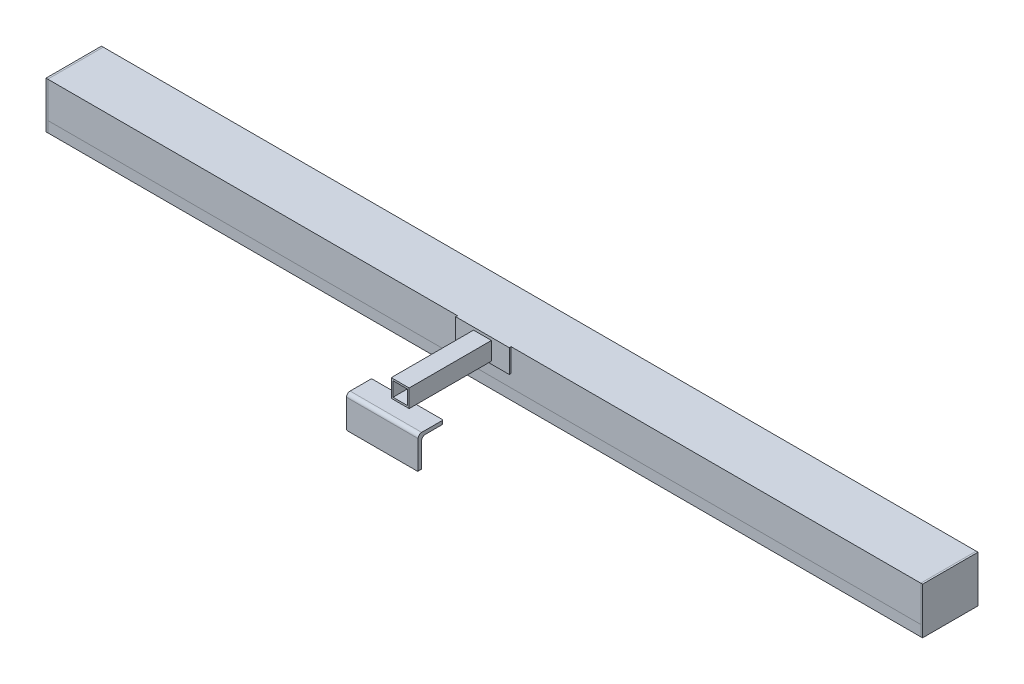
ISO-10303-21;
HEADER;
FILE_DESCRIPTION(('STEP AP214'),'2;1');
FILE_NAME('part.step','',(''),(''),'','','');
FILE_SCHEMA(('AUTOMOTIVE_DESIGN { 1 0 10303 214 1 1 1 1 }'));
ENDSEC;
DATA;
#1=APPLICATION_CONTEXT('core data for automotive mechanical design processes');
#2=APPLICATION_PROTOCOL_DEFINITION('international standard','automotive_design',2000,#1);
#3=PRODUCT_CONTEXT('',#1,'mechanical');
#4=PRODUCT('Part','Part','',(#3));
#5=PRODUCT_RELATED_PRODUCT_CATEGORY('part','',(#4));
#6=PRODUCT_DEFINITION_FORMATION('','',#4);
#7=PRODUCT_DEFINITION_CONTEXT('part definition',#1,'design');
#8=PRODUCT_DEFINITION('design','',#6,#7);
#9=PRODUCT_DEFINITION_SHAPE('','',#8);
#10=(LENGTH_UNIT() NAMED_UNIT(*) SI_UNIT(.MILLI.,.METRE.));
#11=(NAMED_UNIT(*) PLANE_ANGLE_UNIT() SI_UNIT($,.RADIAN.));
#12=(NAMED_UNIT(*) SI_UNIT($,.STERADIAN.) SOLID_ANGLE_UNIT());
#13=UNCERTAINTY_MEASURE_WITH_UNIT(LENGTH_MEASURE(1.E-05),#10,'distance_accuracy_value','');
#14=(GEOMETRIC_REPRESENTATION_CONTEXT(3) GLOBAL_UNCERTAINTY_ASSIGNED_CONTEXT((#13)) GLOBAL_UNIT_ASSIGNED_CONTEXT((#10,
#11,#12)) REPRESENTATION_CONTEXT('',''));
#15=CARTESIAN_POINT('',(0.,0.,0.));
#16=DIRECTION('',(0.,0.,1.));
#17=DIRECTION('',(1.,0.,0.));
#18=AXIS2_PLACEMENT_3D('',#15,#16,#17);
#19=CARTESIAN_POINT('',(245.,20.5,-55.));
#20=DIRECTION('',(0.,0.,-1.));
#21=DIRECTION('',(-1.,0.,0.));
#22=AXIS2_PLACEMENT_3D('',#19,#20,#21);
#23=PLANE('',#22);
#24=DIRECTION('',(0.,-1.,0.));
#25=VECTOR('',#24,1.);
#26=CARTESIAN_POINT('',(244.,20.5,-55.));
#27=LINE('',#26,#25);
#28=CARTESIAN_POINT('',(244.,20.5,-55.));
#29=VERTEX_POINT('',#28);
#30=CARTESIAN_POINT('',(244.,-5.50000000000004,-55.));
#31=VERTEX_POINT('',#30);
#32=EDGE_CURVE('E117',#29,#31,#27,.T.);
#33=ORIENTED_EDGE('',*,*,#32,.T.);
#34=DIRECTION('',(-1.,0.,0.));
#35=VECTOR('',#34,1.);
#36=CARTESIAN_POINT('',(245.,-5.50000000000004,-55.));
#37=LINE('',#36,#35);
#38=CARTESIAN_POINT('',(245.,-5.50000000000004,-55.));
#39=VERTEX_POINT('',#38);
#40=EDGE_CURVE('E12',#39,#31,#37,.T.);
#41=ORIENTED_EDGE('',*,*,#40,.F.);
#42=DIRECTION('',(0.,-1.,0.));
#43=VECTOR('',#42,1.);
#44=CARTESIAN_POINT('',(245.,20.5,-55.));
#45=LINE('',#44,#43);
#46=CARTESIAN_POINT('',(245.,20.5,-55.));
#47=VERTEX_POINT('',#46);
#48=EDGE_CURVE('E105',#47,#39,#45,.T.);
#49=ORIENTED_EDGE('',*,*,#48,.F.);
#50=DIRECTION('',(-1.,0.,0.));
#51=VECTOR('',#50,1.);
#52=CARTESIAN_POINT('',(245.,20.5,-55.));
#53=LINE('',#52,#51);
#54=EDGE_CURVE('E113',#47,#29,#53,.T.);
#55=ORIENTED_EDGE('',*,*,#54,.T.);
#56=EDGE_LOOP('',(#33,#41,#49,#55));
#57=FACE_BOUND('',#56,.T.);
#58=ADVANCED_FACE('F54',(#57),#23,.F.);
#59=CARTESIAN_POINT('',(245.,-5.50000000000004,-55.));
#60=DIRECTION('',(0.,1.,0.));
#61=DIRECTION('',(0.,0.,1.));
#62=AXIS2_PLACEMENT_3D('',#59,#60,#61);
#63=PLANE('',#62);
#64=DIRECTION('',(0.,0.,-1.));
#65=VECTOR('',#64,1.);
#66=CARTESIAN_POINT('',(244.,-5.50000000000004,-55.));
#67=LINE('',#66,#65);
#68=CARTESIAN_POINT('',(244.,-5.50000000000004,-86.));
#69=VERTEX_POINT('',#68);
#70=EDGE_CURVE('E109',#31,#69,#67,.T.);
#71=ORIENTED_EDGE('',*,*,#70,.T.);
#72=DIRECTION('',(-1.,0.,0.));
#73=VECTOR('',#72,1.);
#74=CARTESIAN_POINT('',(245.,-5.50000000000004,-86.));
#75=LINE('',#74,#73);
#76=CARTESIAN_POINT('',(245.,-5.50000000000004,-86.));
#77=VERTEX_POINT('',#76);
#78=EDGE_CURVE('E62',#77,#69,#75,.T.);
#79=ORIENTED_EDGE('',*,*,#78,.F.);
#80=DIRECTION('',(0.,0.,-1.));
#81=VECTOR('',#80,1.);
#82=CARTESIAN_POINT('',(245.,-5.50000000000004,-55.));
#83=LINE('',#82,#81);
#84=EDGE_CURVE('E100',#39,#77,#83,.T.);
#85=ORIENTED_EDGE('',*,*,#84,.F.);
#86=ORIENTED_EDGE('',*,*,#40,.T.);
#87=EDGE_LOOP('',(#71,#79,#85,#86));
#88=FACE_BOUND('',#87,.T.);
#89=ADVANCED_FACE('F108',(#88),#63,.F.);
#90=CARTESIAN_POINT('',(245.,20.5,-86.));
#91=DIRECTION('',(0.,0.,1.));
#92=DIRECTION('',(1.,0.,0.));
#93=AXIS2_PLACEMENT_3D('',#90,#91,#92);
#94=PLANE('',#93);
#95=DIRECTION('',(0.,1.,0.));
#96=VECTOR('',#95,1.);
#97=CARTESIAN_POINT('',(244.,20.5,-86.));
#98=LINE('',#97,#96);
#99=CARTESIAN_POINT('',(244.,20.5,-86.));
#100=VERTEX_POINT('',#99);
#101=EDGE_CURVE('E87',#69,#100,#98,.T.);
#102=ORIENTED_EDGE('',*,*,#101,.T.);
#103=DIRECTION('',(-1.,0.,0.));
#104=VECTOR('',#103,1.);
#105=CARTESIAN_POINT('',(245.,20.5,-86.));
#106=LINE('',#105,#104);
#107=CARTESIAN_POINT('',(245.,20.5,-86.));
#108=VERTEX_POINT('',#107);
#109=EDGE_CURVE('E110',#108,#100,#106,.T.);
#110=ORIENTED_EDGE('',*,*,#109,.F.);
#111=DIRECTION('',(0.,1.,0.));
#112=VECTOR('',#111,1.);
#113=CARTESIAN_POINT('',(245.,20.5,-86.));
#114=LINE('',#113,#112);
#115=EDGE_CURVE('E103',#77,#108,#114,.T.);
#116=ORIENTED_EDGE('',*,*,#115,.F.);
#117=ORIENTED_EDGE('',*,*,#78,.T.);
#118=EDGE_LOOP('',(#102,#110,#116,#117));
#119=FACE_BOUND('',#118,.T.);
#120=ADVANCED_FACE('F111',(#119),#94,.F.);
#121=CARTESIAN_POINT('',(245.,20.5,-55.));
#122=DIRECTION('',(0.,-1.,0.));
#123=DIRECTION('',(0.,0.,-1.));
#124=AXIS2_PLACEMENT_3D('',#121,#122,#123);
#125=PLANE('',#124);
#126=DIRECTION('',(0.,0.,1.));
#127=VECTOR('',#126,1.);
#128=CARTESIAN_POINT('',(244.,20.5,-55.));
#129=LINE('',#128,#127);
#130=EDGE_CURVE('E93',#100,#29,#129,.T.);
#131=ORIENTED_EDGE('',*,*,#130,.T.);
#132=ORIENTED_EDGE('',*,*,#54,.F.);
#133=DIRECTION('',(0.,0.,1.));
#134=VECTOR('',#133,1.);
#135=CARTESIAN_POINT('',(245.,20.5,-55.));
#136=LINE('',#135,#134);
#137=EDGE_CURVE('E70',#108,#47,#136,.T.);
#138=ORIENTED_EDGE('',*,*,#137,.F.);
#139=ORIENTED_EDGE('',*,*,#109,.T.);
#140=EDGE_LOOP('',(#131,#132,#138,#139));
#141=FACE_BOUND('',#140,.T.);
#142=ADVANCED_FACE('F124',(#141),#125,.F.);
#143=CARTESIAN_POINT('',(245.,0.,0.));
#144=DIRECTION('',(1.,0.,0.));
#145=DIRECTION('',(0.,0.,-1.));
#146=AXIS2_PLACEMENT_3D('',#143,#144,#145);
#147=PLANE('',#146);
#148=ORIENTED_EDGE('',*,*,#48,.T.);
#149=ORIENTED_EDGE('',*,*,#84,.T.);
#150=ORIENTED_EDGE('',*,*,#115,.T.);
#151=ORIENTED_EDGE('',*,*,#137,.T.);
#152=EDGE_LOOP('',(#148,#149,#150,#151));
#153=FACE_BOUND('',#152,.T.);
#154=ADVANCED_FACE('F101',(#153),#147,.T.);
#155=CARTESIAN_POINT('',(244.,0.,0.));
#156=DIRECTION('',(1.,0.,0.));
#157=DIRECTION('',(0.,0.,-1.));
#158=AXIS2_PLACEMENT_3D('',#155,#156,#157);
#159=PLANE('',#158);
#160=ORIENTED_EDGE('',*,*,#32,.F.);
#161=ORIENTED_EDGE('',*,*,#130,.F.);
#162=ORIENTED_EDGE('',*,*,#101,.F.);
#163=ORIENTED_EDGE('',*,*,#70,.F.);
#164=EDGE_LOOP('',(#160,#161,#162,#163));
#165=FACE_BOUND('',#164,.T.);
#166=ADVANCED_FACE('F127',(#165),#159,.F.);
#167=CLOSED_SHELL('',(#58,#89,#120,#142,#154,#166));
#168=MANIFOLD_SOLID_BREP('B2',#167);
#169=CARTESIAN_POINT('',(-245.,20.5,-86.));
#170=DIRECTION('',(0.,0.,1.));
#171=DIRECTION('',(1.,0.,0.));
#172=AXIS2_PLACEMENT_3D('',#169,#170,#171);
#173=PLANE('',#172);
#174=DIRECTION('',(0.,-1.,0.));
#175=VECTOR('',#174,1.);
#176=CARTESIAN_POINT('',(-244.,20.5,-86.));
#177=LINE('',#176,#175);
#178=CARTESIAN_POINT('',(-244.,20.5,-86.));
#179=VERTEX_POINT('',#178);
#180=CARTESIAN_POINT('',(-244.,-5.50000000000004,-86.));
#181=VERTEX_POINT('',#180);
#182=EDGE_CURVE('E251',#179,#181,#177,.T.);
#183=ORIENTED_EDGE('',*,*,#182,.T.);
#184=DIRECTION('',(1.,0.,0.));
#185=VECTOR('',#184,1.);
#186=CARTESIAN_POINT('',(-245.,-5.50000000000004,-86.));
#187=LINE('',#186,#185);
#188=CARTESIAN_POINT('',(-245.,-5.50000000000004,-86.));
#189=VERTEX_POINT('',#188);
#190=EDGE_CURVE('E52',#189,#181,#187,.T.);
#191=ORIENTED_EDGE('',*,*,#190,.F.);
#192=DIRECTION('',(0.,-1.,0.));
#193=VECTOR('',#192,1.);
#194=CARTESIAN_POINT('',(-245.,20.5,-86.));
#195=LINE('',#194,#193);
#196=CARTESIAN_POINT('',(-245.,20.5,-86.));
#197=VERTEX_POINT('',#196);
#198=EDGE_CURVE('E239',#197,#189,#195,.T.);
#199=ORIENTED_EDGE('',*,*,#198,.F.);
#200=DIRECTION('',(1.,0.,0.));
#201=VECTOR('',#200,1.);
#202=CARTESIAN_POINT('',(-245.,20.5,-86.));
#203=LINE('',#202,#201);
#204=EDGE_CURVE('E247',#197,#179,#203,.T.);
#205=ORIENTED_EDGE('',*,*,#204,.T.);
#206=EDGE_LOOP('',(#183,#191,#199,#205));
#207=FACE_BOUND('',#206,.T.);
#208=ADVANCED_FACE('F188',(#207),#173,.F.);
#209=CARTESIAN_POINT('',(-245.,-5.50000000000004,-86.));
#210=DIRECTION('',(0.,1.,0.));
#211=DIRECTION('',(0.,0.,1.));
#212=AXIS2_PLACEMENT_3D('',#209,#210,#211);
#213=PLANE('',#212);
#214=DIRECTION('',(0.,0.,1.));
#215=VECTOR('',#214,1.);
#216=CARTESIAN_POINT('',(-244.,-5.50000000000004,-86.));
#217=LINE('',#216,#215);
#218=CARTESIAN_POINT('',(-244.,-5.50000000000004,-55.));
#219=VERTEX_POINT('',#218);
#220=EDGE_CURVE('E243',#181,#219,#217,.T.);
#221=ORIENTED_EDGE('',*,*,#220,.T.);
#222=DIRECTION('',(1.,0.,0.));
#223=VECTOR('',#222,1.);
#224=CARTESIAN_POINT('',(-245.,-5.50000000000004,-55.));
#225=LINE('',#224,#223);
#226=CARTESIAN_POINT('',(-245.,-5.50000000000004,-55.));
#227=VERTEX_POINT('',#226);
#228=EDGE_CURVE('E196',#227,#219,#225,.T.);
#229=ORIENTED_EDGE('',*,*,#228,.F.);
#230=DIRECTION('',(0.,0.,1.));
#231=VECTOR('',#230,1.);
#232=CARTESIAN_POINT('',(-245.,-5.50000000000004,-86.));
#233=LINE('',#232,#231);
#234=EDGE_CURVE('E234',#189,#227,#233,.T.);
#235=ORIENTED_EDGE('',*,*,#234,.F.);
#236=ORIENTED_EDGE('',*,*,#190,.T.);
#237=EDGE_LOOP('',(#221,#229,#235,#236));
#238=FACE_BOUND('',#237,.T.);
#239=ADVANCED_FACE('F242',(#238),#213,.F.);
#240=CARTESIAN_POINT('',(-245.,20.5,-55.));
#241=DIRECTION('',(0.,0.,-1.));
#242=DIRECTION('',(-1.,0.,0.));
#243=AXIS2_PLACEMENT_3D('',#240,#241,#242);
#244=PLANE('',#243);
#245=DIRECTION('',(0.,1.,0.));
#246=VECTOR('',#245,1.);
#247=CARTESIAN_POINT('',(-244.,20.5,-55.));
#248=LINE('',#247,#246);
#249=CARTESIAN_POINT('',(-244.,20.5,-55.));
#250=VERTEX_POINT('',#249);
#251=EDGE_CURVE('E221',#219,#250,#248,.T.);
#252=ORIENTED_EDGE('',*,*,#251,.T.);
#253=DIRECTION('',(1.,0.,0.));
#254=VECTOR('',#253,1.);
#255=CARTESIAN_POINT('',(-245.,20.5,-55.));
#256=LINE('',#255,#254);
#257=CARTESIAN_POINT('',(-245.,20.5,-55.));
#258=VERTEX_POINT('',#257);
#259=EDGE_CURVE('E244',#258,#250,#256,.T.);
#260=ORIENTED_EDGE('',*,*,#259,.F.);
#261=DIRECTION('',(0.,1.,0.));
#262=VECTOR('',#261,1.);
#263=CARTESIAN_POINT('',(-245.,20.5,-55.));
#264=LINE('',#263,#262);
#265=EDGE_CURVE('E237',#227,#258,#264,.T.);
#266=ORIENTED_EDGE('',*,*,#265,.F.);
#267=ORIENTED_EDGE('',*,*,#228,.T.);
#268=EDGE_LOOP('',(#252,#260,#266,#267));
#269=FACE_BOUND('',#268,.T.);
#270=ADVANCED_FACE('F245',(#269),#244,.F.);
#271=CARTESIAN_POINT('',(-245.,20.5,-86.));
#272=DIRECTION('',(0.,-1.,0.));
#273=DIRECTION('',(0.,0.,-1.));
#274=AXIS2_PLACEMENT_3D('',#271,#272,#273);
#275=PLANE('',#274);
#276=DIRECTION('',(0.,0.,-1.));
#277=VECTOR('',#276,1.);
#278=CARTESIAN_POINT('',(-244.,20.5,-86.));
#279=LINE('',#278,#277);
#280=EDGE_CURVE('E227',#250,#179,#279,.T.);
#281=ORIENTED_EDGE('',*,*,#280,.T.);
#282=ORIENTED_EDGE('',*,*,#204,.F.);
#283=DIRECTION('',(0.,0.,-1.));
#284=VECTOR('',#283,1.);
#285=CARTESIAN_POINT('',(-245.,20.5,-86.));
#286=LINE('',#285,#284);
#287=EDGE_CURVE('E204',#258,#197,#286,.T.);
#288=ORIENTED_EDGE('',*,*,#287,.F.);
#289=ORIENTED_EDGE('',*,*,#259,.T.);
#290=EDGE_LOOP('',(#281,#282,#288,#289));
#291=FACE_BOUND('',#290,.T.);
#292=ADVANCED_FACE('F258',(#291),#275,.F.);
#293=CARTESIAN_POINT('',(-245.,0.,0.));
#294=DIRECTION('',(-1.,0.,0.));
#295=DIRECTION('',(0.,0.,1.));
#296=AXIS2_PLACEMENT_3D('',#293,#294,#295);
#297=PLANE('',#296);
#298=ORIENTED_EDGE('',*,*,#198,.T.);
#299=ORIENTED_EDGE('',*,*,#234,.T.);
#300=ORIENTED_EDGE('',*,*,#265,.T.);
#301=ORIENTED_EDGE('',*,*,#287,.T.);
#302=EDGE_LOOP('',(#298,#299,#300,#301));
#303=FACE_BOUND('',#302,.T.);
#304=ADVANCED_FACE('F235',(#303),#297,.T.);
#305=CARTESIAN_POINT('',(-244.,0.,0.));
#306=DIRECTION('',(-1.,0.,0.));
#307=DIRECTION('',(0.,0.,1.));
#308=AXIS2_PLACEMENT_3D('',#305,#306,#307);
#309=PLANE('',#308);
#310=ORIENTED_EDGE('',*,*,#182,.F.);
#311=ORIENTED_EDGE('',*,*,#280,.F.);
#312=ORIENTED_EDGE('',*,*,#251,.F.);
#313=ORIENTED_EDGE('',*,*,#220,.F.);
#314=EDGE_LOOP('',(#310,#311,#312,#313));
#315=FACE_BOUND('',#314,.T.);
#316=ADVANCED_FACE('F261',(#315),#309,.F.);
#317=CLOSED_SHELL('',(#208,#239,#270,#292,#304,#316));
#318=MANIFOLD_SOLID_BREP('B6',#317);
#319=CARTESIAN_POINT('',(-244.,-5.50000000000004,-55.));
#320=DIRECTION('',(1.,0.,0.));
#321=DIRECTION('',(0.,0.,-1.));
#322=AXIS2_PLACEMENT_3D('',#319,#320,#321);
#323=PLANE('',#322);
#324=DIRECTION('',(0.,0.,-1.));
#325=VECTOR('',#324,1.);
#326=CARTESIAN_POINT('',(-244.,0.499999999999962,-55.));
#327=LINE('',#326,#325);
#328=CARTESIAN_POINT('',(-244.,0.499999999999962,-55.));
#329=VERTEX_POINT('',#328);
#330=CARTESIAN_POINT('',(-244.,0.499999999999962,-86.));
#331=VERTEX_POINT('',#330);
#332=EDGE_CURVE('E384',#329,#331,#327,.T.);
#333=ORIENTED_EDGE('',*,*,#332,.T.);
#334=DIRECTION('',(0.,1.,0.));
#335=VECTOR('',#334,1.);
#336=CARTESIAN_POINT('',(-244.,-5.50000000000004,-86.));
#337=LINE('',#336,#335);
#338=CARTESIAN_POINT('',(-244.,-5.50000000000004,-86.));
#339=VERTEX_POINT('',#338);
#340=EDGE_CURVE('E186',#339,#331,#337,.T.);
#341=ORIENTED_EDGE('',*,*,#340,.F.);
#342=DIRECTION('',(0.,0.,-1.));
#343=VECTOR('',#342,1.);
#344=CARTESIAN_POINT('',(-244.,-5.50000000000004,-55.));
#345=LINE('',#344,#343);
#346=CARTESIAN_POINT('',(-244.,-5.50000000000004,-55.));
#347=VERTEX_POINT('',#346);
#348=EDGE_CURVE('E372',#347,#339,#345,.T.);
#349=ORIENTED_EDGE('',*,*,#348,.F.);
#350=DIRECTION('',(0.,1.,0.));
#351=VECTOR('',#350,1.);
#352=CARTESIAN_POINT('',(-244.,-5.50000000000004,-55.));
#353=LINE('',#352,#351);
#354=EDGE_CURVE('E380',#347,#329,#353,.T.);
#355=ORIENTED_EDGE('',*,*,#354,.T.);
#356=EDGE_LOOP('',(#333,#341,#349,#355));
#357=FACE_BOUND('',#356,.T.);
#358=ADVANCED_FACE('F321',(#357),#323,.F.);
#359=CARTESIAN_POINT('',(-244.,-5.50000000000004,-86.));
#360=DIRECTION('',(0.,0.,1.));
#361=DIRECTION('',(1.,0.,0.));
#362=AXIS2_PLACEMENT_3D('',#359,#360,#361);
#363=PLANE('',#362);
#364=DIRECTION('',(1.,0.,0.));
#365=VECTOR('',#364,1.);
#366=CARTESIAN_POINT('',(-244.,0.499999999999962,-86.));
#367=LINE('',#366,#365);
#368=CARTESIAN_POINT('',(244.,0.499999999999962,-86.));
#369=VERTEX_POINT('',#368);
#370=EDGE_CURVE('E376',#331,#369,#367,.T.);
#371=ORIENTED_EDGE('',*,*,#370,.T.);
#372=DIRECTION('',(0.,1.,0.));
#373=VECTOR('',#372,1.);
#374=CARTESIAN_POINT('',(244.,-5.50000000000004,-86.));
#375=LINE('',#374,#373);
#376=CARTESIAN_POINT('',(244.,-5.50000000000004,-86.));
#377=VERTEX_POINT('',#376);
#378=EDGE_CURVE('E329',#377,#369,#375,.T.);
#379=ORIENTED_EDGE('',*,*,#378,.F.);
#380=DIRECTION('',(1.,0.,0.));
#381=VECTOR('',#380,1.);
#382=CARTESIAN_POINT('',(-244.,-5.50000000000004,-86.));
#383=LINE('',#382,#381);
#384=EDGE_CURVE('E367',#339,#377,#383,.T.);
#385=ORIENTED_EDGE('',*,*,#384,.F.);
#386=ORIENTED_EDGE('',*,*,#340,.T.);
#387=EDGE_LOOP('',(#371,#379,#385,#386));
#388=FACE_BOUND('',#387,.T.);
#389=ADVANCED_FACE('F375',(#388),#363,.F.);
#390=CARTESIAN_POINT('',(244.,-5.50000000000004,-55.));
#391=DIRECTION('',(-1.,0.,0.));
#392=DIRECTION('',(0.,0.,1.));
#393=AXIS2_PLACEMENT_3D('',#390,#391,#392);
#394=PLANE('',#393);
#395=DIRECTION('',(0.,0.,1.));
#396=VECTOR('',#395,1.);
#397=CARTESIAN_POINT('',(244.,0.499999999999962,-55.));
#398=LINE('',#397,#396);
#399=CARTESIAN_POINT('',(244.,0.499999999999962,-55.));
#400=VERTEX_POINT('',#399);
#401=EDGE_CURVE('E354',#369,#400,#398,.T.);
#402=ORIENTED_EDGE('',*,*,#401,.T.);
#403=DIRECTION('',(0.,1.,0.));
#404=VECTOR('',#403,1.);
#405=CARTESIAN_POINT('',(244.,-5.50000000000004,-55.));
#406=LINE('',#405,#404);
#407=CARTESIAN_POINT('',(244.,-5.50000000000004,-55.));
#408=VERTEX_POINT('',#407);
#409=EDGE_CURVE('E377',#408,#400,#406,.T.);
#410=ORIENTED_EDGE('',*,*,#409,.F.);
#411=DIRECTION('',(0.,0.,1.));
#412=VECTOR('',#411,1.);
#413=CARTESIAN_POINT('',(244.,-5.50000000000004,-55.));
#414=LINE('',#413,#412);
#415=EDGE_CURVE('E370',#377,#408,#414,.T.);
#416=ORIENTED_EDGE('',*,*,#415,.F.);
#417=ORIENTED_EDGE('',*,*,#378,.T.);
#418=EDGE_LOOP('',(#402,#410,#416,#417));
#419=FACE_BOUND('',#418,.T.);
#420=ADVANCED_FACE('F378',(#419),#394,.F.);
#421=CARTESIAN_POINT('',(-244.,-5.50000000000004,-55.));
#422=DIRECTION('',(0.,0.,-1.));
#423=DIRECTION('',(-1.,0.,0.));
#424=AXIS2_PLACEMENT_3D('',#421,#422,#423);
#425=PLANE('',#424);
#426=DIRECTION('',(-1.,0.,0.));
#427=VECTOR('',#426,1.);
#428=CARTESIAN_POINT('',(-244.,0.499999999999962,-55.));
#429=LINE('',#428,#427);
#430=EDGE_CURVE('E360',#400,#329,#429,.T.);
#431=ORIENTED_EDGE('',*,*,#430,.T.);
#432=ORIENTED_EDGE('',*,*,#354,.F.);
#433=DIRECTION('',(-1.,0.,0.));
#434=VECTOR('',#433,1.);
#435=CARTESIAN_POINT('',(-244.,-5.50000000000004,-55.));
#436=LINE('',#435,#434);
#437=EDGE_CURVE('E337',#408,#347,#436,.T.);
#438=ORIENTED_EDGE('',*,*,#437,.F.);
#439=ORIENTED_EDGE('',*,*,#409,.T.);
#440=EDGE_LOOP('',(#431,#432,#438,#439));
#441=FACE_BOUND('',#440,.T.);
#442=ADVANCED_FACE('F391',(#441),#425,.F.);
#443=CARTESIAN_POINT('',(0.,-5.50000000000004,0.));
#444=DIRECTION('',(0.,-1.,0.));
#445=DIRECTION('',(0.,0.,-1.));
#446=AXIS2_PLACEMENT_3D('',#443,#444,#445);
#447=PLANE('',#446);
#448=ORIENTED_EDGE('',*,*,#348,.T.);
#449=ORIENTED_EDGE('',*,*,#384,.T.);
#450=ORIENTED_EDGE('',*,*,#415,.T.);
#451=ORIENTED_EDGE('',*,*,#437,.T.);
#452=EDGE_LOOP('',(#448,#449,#450,#451));
#453=FACE_BOUND('',#452,.T.);
#454=ADVANCED_FACE('F368',(#453),#447,.T.);
#455=CARTESIAN_POINT('',(0.,0.499999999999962,0.));
#456=DIRECTION('',(0.,-1.,0.));
#457=DIRECTION('',(0.,0.,-1.));
#458=AXIS2_PLACEMENT_3D('',#455,#456,#457);
#459=PLANE('',#458);
#460=ORIENTED_EDGE('',*,*,#332,.F.);
#461=ORIENTED_EDGE('',*,*,#430,.F.);
#462=ORIENTED_EDGE('',*,*,#401,.F.);
#463=ORIENTED_EDGE('',*,*,#370,.F.);
#464=EDGE_LOOP('',(#460,#461,#462,#463));
#465=FACE_BOUND('',#464,.T.);
#466=ADVANCED_FACE('F394',(#465),#459,.F.);
#467=CLOSED_SHELL('',(#358,#389,#420,#442,#454,#466));
#468=MANIFOLD_SOLID_BREP('B46',#467);
#469=CARTESIAN_POINT('',(-20.,9.,2.));
#470=DIRECTION('',(0.,-1.,0.));
#471=DIRECTION('',(0.,0.,-1.));
#472=AXIS2_PLACEMENT_3D('',#469,#470,#471);
#473=PLANE('',#472);
#474=DIRECTION('',(0.,0.,1.));
#475=VECTOR('',#474,1.);
#476=CARTESIAN_POINT('',(-5.,9.,-54.));
#477=LINE('',#476,#475);
#478=CARTESIAN_POINT('',(-5.,9.,-12.));
#479=VERTEX_POINT('',#478);
#480=CARTESIAN_POINT('',(-5.,9.,-8.));
#481=VERTEX_POINT('',#480);
#482=EDGE_CURVE('E777',#479,#481,#477,.T.);
#483=ORIENTED_EDGE('',*,*,#482,.F.);
#484=DIRECTION('',(-1.,0.,0.));
#485=VECTOR('',#484,1.);
#486=CARTESIAN_POINT('',(0.,9.,-12.));
#487=LINE('',#486,#485);
#488=CARTESIAN_POINT('',(-19.5,9.,-12.));
#489=VERTEX_POINT('',#488);
#490=EDGE_CURVE('E776',#479,#489,#487,.T.);
#491=ORIENTED_EDGE('',*,*,#490,.T.);
#492=CARTESIAN_POINT('',(-19.5,9.,-11.5));
#493=DIRECTION('',(0.,-1.,0.));
#494=DIRECTION('',(0.,0.,-1.));
#495=AXIS2_PLACEMENT_3D('',#492,#493,#494);
#496=CIRCLE('',#495,0.5);
#497=CARTESIAN_POINT('',(-20.,9.,-11.5));
#498=VERTEX_POINT('',#497);
#499=EDGE_CURVE('E908',#489,#498,#496,.F.);
#500=ORIENTED_EDGE('',*,*,#499,.T.);
#501=DIRECTION('',(0.,0.,-1.));
#502=VECTOR('',#501,1.);
#503=CARTESIAN_POINT('',(-20.,9.,2.));
#504=LINE('',#503,#502);
#505=CARTESIAN_POINT('',(-20.,9.,0.));
#506=VERTEX_POINT('',#505);
#507=EDGE_CURVE('E827',#506,#498,#504,.T.);
#508=ORIENTED_EDGE('',*,*,#507,.F.);
#509=DIRECTION('',(-1.,0.,0.));
#510=VECTOR('',#509,1.);
#511=CARTESIAN_POINT('',(-20.,9.,0.));
#512=LINE('',#511,#510);
#513=CARTESIAN_POINT('',(20.,9.,0.));
#514=VERTEX_POINT('',#513);
#515=EDGE_CURVE('E864',#506,#514,#512,.F.);
#516=ORIENTED_EDGE('',*,*,#515,.T.);
#517=DIRECTION('',(0.,0.,-1.));
#518=VECTOR('',#517,1.);
#519=CARTESIAN_POINT('',(20.,9.,2.));
#520=LINE('',#519,#518);
#521=CARTESIAN_POINT('',(20.,9.,-11.5));
#522=VERTEX_POINT('',#521);
#523=EDGE_CURVE('E839',#514,#522,#520,.T.);
#524=ORIENTED_EDGE('',*,*,#523,.T.);
#525=CARTESIAN_POINT('',(19.5,9.,-11.5));
#526=DIRECTION('',(0.,-1.,0.));
#527=DIRECTION('',(0.,0.,-1.));
#528=AXIS2_PLACEMENT_3D('',#525,#526,#527);
#529=CIRCLE('',#528,0.5);
#530=CARTESIAN_POINT('',(19.5,9.,-12.));
#531=VERTEX_POINT('',#530);
#532=EDGE_CURVE('E454',#522,#531,#529,.F.);
#533=ORIENTED_EDGE('',*,*,#532,.T.);
#534=CARTESIAN_POINT('',(5.,9.,-12.));
#535=VERTEX_POINT('',#534);
#536=EDGE_CURVE('E805',#531,#535,#487,.T.);
#537=ORIENTED_EDGE('',*,*,#536,.T.);
#538=DIRECTION('',(0.,0.,1.));
#539=VECTOR('',#538,1.);
#540=CARTESIAN_POINT('',(5.,9.,-54.));
#541=LINE('',#540,#539);
#542=CARTESIAN_POINT('',(5.,9.,-8.));
#543=VERTEX_POINT('',#542);
#544=EDGE_CURVE('E466',#535,#543,#541,.T.);
#545=ORIENTED_EDGE('',*,*,#544,.T.);
#546=DIRECTION('',(1.,0.,0.));
#547=VECTOR('',#546,1.);
#548=CARTESIAN_POINT('',(0.,9.,-8.));
#549=LINE('',#548,#547);
#550=EDGE_CURVE('E461',#481,#543,#549,.T.);
#551=ORIENTED_EDGE('',*,*,#550,.F.);
#552=EDGE_LOOP('',(#483,#491,#500,#508,#516,#524,#533,#537,#545,#551));
#553=FACE_BOUND('',#552,.T.);
#554=ADVANCED_FACE('F445',(#553),#473,.F.);
#555=CARTESIAN_POINT('',(19.5,7.,-11.5));
#556=DIRECTION('',(0.,1.,0.));
#557=DIRECTION('',(0.,0.,1.));
#558=AXIS2_PLACEMENT_3D('',#555,#556,#557);
#559=CYLINDRICAL_SURFACE('',#558,0.5);
#560=DIRECTION('',(0.,-1.,0.));
#561=VECTOR('',#560,1.);
#562=CARTESIAN_POINT('',(19.5,7.,-12.));
#563=LINE('',#562,#561);
#564=CARTESIAN_POINT('',(19.5,7.,-12.));
#565=VERTEX_POINT('',#564);
#566=EDGE_CURVE('E915',#531,#565,#563,.T.);
#567=ORIENTED_EDGE('',*,*,#566,.F.);
#568=ORIENTED_EDGE('',*,*,#532,.F.);
#569=DIRECTION('',(0.,-1.,0.));
#570=VECTOR('',#569,1.);
#571=CARTESIAN_POINT('',(20.,7.,-11.5));
#572=LINE('',#571,#570);
#573=CARTESIAN_POINT('',(20.,7.,-11.5));
#574=VERTEX_POINT('',#573);
#575=EDGE_CURVE('E919',#574,#522,#572,.F.);
#576=ORIENTED_EDGE('',*,*,#575,.F.);
#577=CARTESIAN_POINT('',(19.5,7.,-11.5));
#578=DIRECTION('',(0.,1.,0.));
#579=DIRECTION('',(0.,0.,1.));
#580=AXIS2_PLACEMENT_3D('',#577,#578,#579);
#581=CIRCLE('',#580,0.5);
#582=EDGE_CURVE('E319',#565,#574,#581,.F.);
#583=ORIENTED_EDGE('',*,*,#582,.F.);
#584=EDGE_LOOP('',(#567,#568,#576,#583));
#585=FACE_BOUND('',#584,.T.);
#586=ADVANCED_FACE('F447',(#585),#559,.T.);
#587=CARTESIAN_POINT('',(-19.5,-9.,-11.5));
#588=DIRECTION('',(0.,1.,0.));
#589=DIRECTION('',(0.,0.,1.));
#590=AXIS2_PLACEMENT_3D('',#587,#588,#589);
#591=CYLINDRICAL_SURFACE('',#590,0.5);
#592=DIRECTION('',(0.,-1.,0.));
#593=VECTOR('',#592,1.);
#594=CARTESIAN_POINT('',(-20.,-9.,-11.5));
#595=LINE('',#594,#593);
#596=CARTESIAN_POINT('',(-20.,7.,-11.5));
#597=VERTEX_POINT('',#596);
#598=EDGE_CURVE('E900',#498,#597,#595,.T.);
#599=ORIENTED_EDGE('',*,*,#598,.F.);
#600=ORIENTED_EDGE('',*,*,#499,.F.);
#601=DIRECTION('',(0.,-1.,0.));
#602=VECTOR('',#601,1.);
#603=CARTESIAN_POINT('',(-19.5,-9.,-12.));
#604=LINE('',#603,#602);
#605=CARTESIAN_POINT('',(-19.5,7.,-12.));
#606=VERTEX_POINT('',#605);
#607=EDGE_CURVE('E904',#606,#489,#604,.F.);
#608=ORIENTED_EDGE('',*,*,#607,.F.);
#609=CARTESIAN_POINT('',(-19.5,7.,-11.5));
#610=DIRECTION('',(0.,1.,0.));
#611=DIRECTION('',(0.,0.,1.));
#612=AXIS2_PLACEMENT_3D('',#609,#610,#611);
#613=CIRCLE('',#612,0.5);
#614=EDGE_CURVE('E911',#597,#606,#613,.F.);
#615=ORIENTED_EDGE('',*,*,#614,.F.);
#616=EDGE_LOOP('',(#599,#600,#608,#615));
#617=FACE_BOUND('',#616,.T.);
#618=ADVANCED_FACE('F941',(#617),#591,.T.);
#619=CARTESIAN_POINT('',(-19.5,-8.5,2.));
#620=DIRECTION('',(0.,0.,-1.));
#621=DIRECTION('',(-1.,0.,0.));
#622=AXIS2_PLACEMENT_3D('',#619,#620,#621);
#623=CYLINDRICAL_SURFACE('',#622,0.5);
#624=DIRECTION('',(0.,0.,-1.));
#625=VECTOR('',#624,1.);
#626=CARTESIAN_POINT('',(-19.5,-9.,2.));
#627=LINE('',#626,#625);
#628=CARTESIAN_POINT('',(-19.5,-9.,2.));
#629=VERTEX_POINT('',#628);
#630=CARTESIAN_POINT('',(-19.5,-9.,0.));
#631=VERTEX_POINT('',#630);
#632=EDGE_CURVE('E886',#629,#631,#627,.T.);
#633=ORIENTED_EDGE('',*,*,#632,.F.);
#634=CARTESIAN_POINT('',(-19.5,-8.5,2.));
#635=DIRECTION('',(0.,0.,-1.));
#636=DIRECTION('',(-1.,0.,0.));
#637=AXIS2_PLACEMENT_3D('',#634,#635,#636);
#638=CIRCLE('',#637,0.5);
#639=CARTESIAN_POINT('',(-20.,-8.5,2.));
#640=VERTEX_POINT('',#639);
#641=EDGE_CURVE('E894',#640,#629,#638,.F.);
#642=ORIENTED_EDGE('',*,*,#641,.F.);
#643=DIRECTION('',(0.,0.,-1.));
#644=VECTOR('',#643,1.);
#645=CARTESIAN_POINT('',(-20.,-8.5,2.));
#646=LINE('',#645,#644);
#647=CARTESIAN_POINT('',(-20.,-8.5,0.));
#648=VERTEX_POINT('',#647);
#649=EDGE_CURVE('E890',#648,#640,#646,.F.);
#650=ORIENTED_EDGE('',*,*,#649,.F.);
#651=CARTESIAN_POINT('',(-19.5,-8.5,0.));
#652=DIRECTION('',(0.,0.,-1.));
#653=DIRECTION('',(-1.,0.,0.));
#654=AXIS2_PLACEMENT_3D('',#651,#652,#653);
#655=CIRCLE('',#654,0.5);
#656=EDGE_CURVE('E897',#631,#648,#655,.T.);
#657=ORIENTED_EDGE('',*,*,#656,.F.);
#658=EDGE_LOOP('',(#633,#642,#650,#657));
#659=FACE_BOUND('',#658,.T.);
#660=ADVANCED_FACE('F971',(#659),#623,.T.);
#661=CARTESIAN_POINT('',(19.6464466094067,-8.64644660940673,0.));
#662=DIRECTION('',(0.,0.,1.));
#663=DIRECTION('',(1.,0.,0.));
#664=AXIS2_PLACEMENT_3D('',#661,#662,#663);
#665=CYLINDRICAL_SURFACE('',#664,0.353553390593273);
#666=DIRECTION('',(0.,0.,1.));
#667=VECTOR('',#666,1.);
#668=CARTESIAN_POINT('',(19.6464466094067,-9.,2.));
#669=LINE('',#668,#667);
#670=CARTESIAN_POINT('',(19.6464466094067,-9.,0.));
#671=VERTEX_POINT('',#670);
#672=CARTESIAN_POINT('',(19.6464466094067,-9.,2.));
#673=VERTEX_POINT('',#672);
#674=EDGE_CURVE('E871',#671,#673,#669,.T.);
#675=ORIENTED_EDGE('',*,*,#674,.F.);
#676=CARTESIAN_POINT('',(19.6464466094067,-8.64644660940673,0.));
#677=DIRECTION('',(0.,0.,-1.));
#678=DIRECTION('',(-1.,0.,0.));
#679=AXIS2_PLACEMENT_3D('',#676,#677,#678);
#680=CIRCLE('',#679,0.353553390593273);
#681=CARTESIAN_POINT('',(20.,-8.64644660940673,0.));
#682=VERTEX_POINT('',#681);
#683=EDGE_CURVE('E879',#682,#671,#680,.T.);
#684=ORIENTED_EDGE('',*,*,#683,.F.);
#685=DIRECTION('',(0.,0.,1.));
#686=VECTOR('',#685,1.);
#687=CARTESIAN_POINT('',(20.,-8.64644660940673,2.));
#688=LINE('',#687,#686);
#689=CARTESIAN_POINT('',(20.,-8.64644660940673,2.));
#690=VERTEX_POINT('',#689);
#691=EDGE_CURVE('E875',#690,#682,#688,.F.);
#692=ORIENTED_EDGE('',*,*,#691,.F.);
#693=CARTESIAN_POINT('',(19.6464466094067,-8.64644660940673,2.));
#694=DIRECTION('',(0.,0.,-1.));
#695=DIRECTION('',(-1.,0.,0.));
#696=AXIS2_PLACEMENT_3D('',#693,#694,#695);
#697=CIRCLE('',#696,0.353553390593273);
#698=EDGE_CURVE('E883',#673,#690,#697,.F.);
#699=ORIENTED_EDGE('',*,*,#698,.F.);
#700=EDGE_LOOP('',(#675,#684,#692,#699));
#701=FACE_BOUND('',#700,.T.);
#702=ADVANCED_FACE('F979',(#701),#665,.T.);
#703=CARTESIAN_POINT('',(0.,0.,0.));
#704=DIRECTION('',(0.,0.,-1.));
#705=DIRECTION('',(-1.,0.,0.));
#706=AXIS2_PLACEMENT_3D('',#703,#704,#705);
#707=PLANE('',#706);
#708=DIRECTION('',(1.,0.,0.));
#709=VECTOR('',#708,1.);
#710=CARTESIAN_POINT('',(-20.,-9.,0.));
#711=LINE('',#710,#709);
#712=EDGE_CURVE('E831',#631,#671,#711,.T.);
#713=ORIENTED_EDGE('',*,*,#712,.F.);
#714=ORIENTED_EDGE('',*,*,#656,.T.);
#715=DIRECTION('',(0.,-1.,0.));
#716=VECTOR('',#715,1.);
#717=CARTESIAN_POINT('',(-20.,-9.,0.));
#718=LINE('',#717,#716);
#719=CARTESIAN_POINT('',(-20.,5.,0.));
#720=VERTEX_POINT('',#719);
#721=EDGE_CURVE('E812',#720,#648,#718,.T.);
#722=ORIENTED_EDGE('',*,*,#721,.F.);
#723=DIRECTION('',(1.,0.,0.));
#724=VECTOR('',#723,1.);
#725=CARTESIAN_POINT('',(0.,5.,0.));
#726=LINE('',#725,#724);
#727=CARTESIAN_POINT('',(20.,5.,0.));
#728=VERTEX_POINT('',#727);
#729=EDGE_CURVE('E843',#720,#728,#726,.T.);
#730=ORIENTED_EDGE('',*,*,#729,.T.);
#731=DIRECTION('',(0.,1.,0.));
#732=VECTOR('',#731,1.);
#733=CARTESIAN_POINT('',(20.,-9.,0.));
#734=LINE('',#733,#732);
#735=EDGE_CURVE('E821',#682,#728,#734,.T.);
#736=ORIENTED_EDGE('',*,*,#735,.F.);
#737=ORIENTED_EDGE('',*,*,#683,.T.);
#738=EDGE_LOOP('',(#713,#714,#722,#730,#736,#737));
#739=FACE_BOUND('',#738,.T.);
#740=ADVANCED_FACE('F966',(#739),#707,.T.);
#741=CARTESIAN_POINT('',(-20.,-9.,2.));
#742=DIRECTION('',(1.,0.,0.));
#743=DIRECTION('',(0.,0.,-1.));
#744=AXIS2_PLACEMENT_3D('',#741,#742,#743);
#745=PLANE('',#744);
#746=ORIENTED_EDGE('',*,*,#507,.T.);
#747=ORIENTED_EDGE('',*,*,#598,.T.);
#748=DIRECTION('',(0.,0.,1.));
#749=VECTOR('',#748,1.);
#750=CARTESIAN_POINT('',(-20.,7.,-12.));
#751=LINE('',#750,#749);
#752=CARTESIAN_POINT('',(-20.,7.,-2.));
#753=VERTEX_POINT('',#752);
#754=EDGE_CURVE('E804',#597,#753,#751,.T.);
#755=ORIENTED_EDGE('',*,*,#754,.T.);
#756=CARTESIAN_POINT('',(-20.,5.,-2.));
#757=DIRECTION('',(1.,0.,0.));
#758=DIRECTION('',(0.,0.,-1.));
#759=AXIS2_PLACEMENT_3D('',#756,#757,#758);
#760=CIRCLE('',#759,2.);
#761=EDGE_CURVE('E854',#753,#720,#760,.T.);
#762=ORIENTED_EDGE('',*,*,#761,.T.);
#763=ORIENTED_EDGE('',*,*,#721,.T.);
#764=ORIENTED_EDGE('',*,*,#649,.T.);
#765=DIRECTION('',(0.,-1.,0.));
#766=VECTOR('',#765,1.);
#767=CARTESIAN_POINT('',(-20.,-9.,2.));
#768=LINE('',#767,#766);
#769=CARTESIAN_POINT('',(-20.,7.,2.));
#770=VERTEX_POINT('',#769);
#771=EDGE_CURVE('E816',#770,#640,#768,.T.);
#772=ORIENTED_EDGE('',*,*,#771,.F.);
#773=CARTESIAN_POINT('',(-20.,7.,0.));
#774=DIRECTION('',(1.,0.,0.));
#775=DIRECTION('',(0.,0.,-1.));
#776=AXIS2_PLACEMENT_3D('',#773,#774,#775);
#777=CIRCLE('',#776,2.);
#778=EDGE_CURVE('E861',#770,#506,#777,.F.);
#779=ORIENTED_EDGE('',*,*,#778,.T.);
#780=EDGE_LOOP('',(#746,#747,#755,#762,#763,#764,#772,#779));
#781=FACE_BOUND('',#780,.T.);
#782=ADVANCED_FACE('F946',(#781),#745,.F.);
#783=CARTESIAN_POINT('',(-20.,-9.,2.));
#784=DIRECTION('',(0.,1.,0.));
#785=DIRECTION('',(0.,0.,1.));
#786=AXIS2_PLACEMENT_3D('',#783,#784,#785);
#787=PLANE('',#786);
#788=DIRECTION('',(1.,0.,0.));
#789=VECTOR('',#788,1.);
#790=CARTESIAN_POINT('',(-20.,-9.,2.));
#791=LINE('',#790,#789);
#792=EDGE_CURVE('E820',#629,#673,#791,.T.);
#793=ORIENTED_EDGE('',*,*,#792,.F.);
#794=ORIENTED_EDGE('',*,*,#632,.T.);
#795=ORIENTED_EDGE('',*,*,#712,.T.);
#796=ORIENTED_EDGE('',*,*,#674,.T.);
#797=EDGE_LOOP('',(#793,#794,#795,#796));
#798=FACE_BOUND('',#797,.T.);
#799=ADVANCED_FACE('F981',(#798),#787,.F.);
#800=CARTESIAN_POINT('',(20.,-9.,2.));
#801=DIRECTION('',(-1.,0.,0.));
#802=DIRECTION('',(0.,0.,1.));
#803=AXIS2_PLACEMENT_3D('',#800,#801,#802);
#804=PLANE('',#803);
#805=DIRECTION('',(0.,0.,-1.));
#806=VECTOR('',#805,1.);
#807=CARTESIAN_POINT('',(20.,7.,2.));
#808=LINE('',#807,#806);
#809=CARTESIAN_POINT('',(20.,7.,-2.));
#810=VERTEX_POINT('',#809);
#811=EDGE_CURVE('E808',#810,#574,#808,.T.);
#812=ORIENTED_EDGE('',*,*,#811,.T.);
#813=ORIENTED_EDGE('',*,*,#575,.T.);
#814=ORIENTED_EDGE('',*,*,#523,.F.);
#815=CARTESIAN_POINT('',(20.,7.,0.));
#816=DIRECTION('',(-1.,0.,0.));
#817=DIRECTION('',(0.,0.,1.));
#818=AXIS2_PLACEMENT_3D('',#815,#816,#817);
#819=CIRCLE('',#818,2.);
#820=CARTESIAN_POINT('',(20.,7.,2.));
#821=VERTEX_POINT('',#820);
#822=EDGE_CURVE('E867',#514,#821,#819,.F.);
#823=ORIENTED_EDGE('',*,*,#822,.T.);
#824=DIRECTION('',(0.,1.,0.));
#825=VECTOR('',#824,1.);
#826=CARTESIAN_POINT('',(20.,-9.,2.));
#827=LINE('',#826,#825);
#828=EDGE_CURVE('E824',#690,#821,#827,.T.);
#829=ORIENTED_EDGE('',*,*,#828,.F.);
#830=ORIENTED_EDGE('',*,*,#691,.T.);
#831=ORIENTED_EDGE('',*,*,#735,.T.);
#832=CARTESIAN_POINT('',(20.,5.,-2.));
#833=DIRECTION('',(-1.,0.,0.));
#834=DIRECTION('',(0.,0.,1.));
#835=AXIS2_PLACEMENT_3D('',#832,#833,#834);
#836=CIRCLE('',#835,2.);
#837=EDGE_CURVE('E851',#728,#810,#836,.T.);
#838=ORIENTED_EDGE('',*,*,#837,.T.);
#839=EDGE_LOOP('',(#812,#813,#814,#823,#829,#830,#831,#838));
#840=FACE_BOUND('',#839,.T.);
#841=ADVANCED_FACE('F955',(#840),#804,.F.);
#842=CARTESIAN_POINT('',(0.,0.,2.));
#843=DIRECTION('',(0.,0.,-1.));
#844=DIRECTION('',(-1.,0.,0.));
#845=AXIS2_PLACEMENT_3D('',#842,#843,#844);
#846=PLANE('',#845);
#847=ORIENTED_EDGE('',*,*,#771,.T.);
#848=ORIENTED_EDGE('',*,*,#641,.T.);
#849=ORIENTED_EDGE('',*,*,#792,.T.);
#850=ORIENTED_EDGE('',*,*,#698,.T.);
#851=ORIENTED_EDGE('',*,*,#828,.T.);
#852=DIRECTION('',(-1.,0.,0.));
#853=VECTOR('',#852,1.);
#854=CARTESIAN_POINT('',(0.,7.,2.));
#855=LINE('',#854,#853);
#856=EDGE_CURVE('E857',#821,#770,#855,.T.);
#857=ORIENTED_EDGE('',*,*,#856,.T.);
#858=EDGE_LOOP('',(#847,#848,#849,#850,#851,#857));
#859=FACE_BOUND('',#858,.T.);
#860=ADVANCED_FACE('F973',(#859),#846,.F.);
#861=CARTESIAN_POINT('',(0.,7.,-12.));
#862=DIRECTION('',(0.,0.,-1.));
#863=DIRECTION('',(-1.,0.,0.));
#864=AXIS2_PLACEMENT_3D('',#861,#862,#863);
#865=PLANE('',#864);
#866=ORIENTED_EDGE('',*,*,#536,.F.);
#867=ORIENTED_EDGE('',*,*,#566,.T.);
#868=DIRECTION('',(-1.,0.,0.));
#869=VECTOR('',#868,1.);
#870=CARTESIAN_POINT('',(20.,7.,-12.));
#871=LINE('',#870,#869);
#872=EDGE_CURVE('E801',#565,#606,#871,.T.);
#873=ORIENTED_EDGE('',*,*,#872,.T.);
#874=ORIENTED_EDGE('',*,*,#607,.T.);
#875=ORIENTED_EDGE('',*,*,#490,.F.);
#876=EDGE_CURVE('E815',#535,#479,#487,.T.);
#877=ORIENTED_EDGE('',*,*,#876,.F.);
#878=EDGE_LOOP('',(#866,#867,#873,#874,#875,#877));
#879=FACE_BOUND('',#878,.T.);
#880=ADVANCED_FACE('F930',(#879),#865,.T.);
#881=CARTESIAN_POINT('',(0.,7.,0.));
#882=DIRECTION('',(0.,1.,0.));
#883=DIRECTION('',(0.,0.,1.));
#884=AXIS2_PLACEMENT_3D('',#881,#882,#883);
#885=PLANE('',#884);
#886=ORIENTED_EDGE('',*,*,#872,.F.);
#887=ORIENTED_EDGE('',*,*,#582,.T.);
#888=ORIENTED_EDGE('',*,*,#811,.F.);
#889=DIRECTION('',(1.,0.,0.));
#890=VECTOR('',#889,1.);
#891=CARTESIAN_POINT('',(0.,7.,-2.));
#892=LINE('',#891,#890);
#893=EDGE_CURVE('E847',#810,#753,#892,.F.);
#894=ORIENTED_EDGE('',*,*,#893,.T.);
#895=ORIENTED_EDGE('',*,*,#754,.F.);
#896=ORIENTED_EDGE('',*,*,#614,.T.);
#897=EDGE_LOOP('',(#886,#887,#888,#894,#895,#896));
#898=FACE_BOUND('',#897,.T.);
#899=ADVANCED_FACE('F944',(#898),#885,.F.);
#900=CARTESIAN_POINT('',(0.,5.,-2.));
#901=DIRECTION('',(1.,0.,0.));
#902=DIRECTION('',(0.,0.,-1.));
#903=AXIS2_PLACEMENT_3D('',#900,#901,#902);
#904=CYLINDRICAL_SURFACE('',#903,2.);
#905=ORIENTED_EDGE('',*,*,#761,.F.);
#906=ORIENTED_EDGE('',*,*,#893,.F.);
#907=ORIENTED_EDGE('',*,*,#837,.F.);
#908=ORIENTED_EDGE('',*,*,#729,.F.);
#909=EDGE_LOOP('',(#905,#906,#907,#908));
#910=FACE_BOUND('',#909,.T.);
#911=ADVANCED_FACE('F961',(#910),#904,.F.);
#912=CARTESIAN_POINT('',(0.,7.,0.));
#913=DIRECTION('',(-1.,0.,0.));
#914=DIRECTION('',(0.,0.,1.));
#915=AXIS2_PLACEMENT_3D('',#912,#913,#914);
#916=CYLINDRICAL_SURFACE('',#915,2.);
#917=ORIENTED_EDGE('',*,*,#822,.F.);
#918=ORIENTED_EDGE('',*,*,#515,.F.);
#919=ORIENTED_EDGE('',*,*,#778,.F.);
#920=ORIENTED_EDGE('',*,*,#856,.F.);
#921=EDGE_LOOP('',(#917,#918,#919,#920));
#922=FACE_BOUND('',#921,.T.);
#923=ADVANCED_FACE('F951',(#922),#916,.T.);
#924=CARTESIAN_POINT('',(0.,9.,-54.));
#925=DIRECTION('',(0.,-1.,0.));
#926=DIRECTION('',(0.,0.,-1.));
#927=AXIS2_PLACEMENT_3D('',#924,#925,#926);
#928=PLANE('',#927);
#929=CARTESIAN_POINT('',(5.,9.,-54.));
#930=VERTEX_POINT('',#929);
#931=EDGE_CURVE('E785',#930,#535,#541,.T.);
#932=ORIENTED_EDGE('',*,*,#931,.T.);
#933=ORIENTED_EDGE('',*,*,#876,.T.);
#934=CARTESIAN_POINT('',(-5.,9.,-54.));
#935=VERTEX_POINT('',#934);
#936=EDGE_CURVE('E772',#935,#479,#477,.T.);
#937=ORIENTED_EDGE('',*,*,#936,.F.);
#938=DIRECTION('',(1.,0.,0.));
#939=VECTOR('',#938,1.);
#940=CARTESIAN_POINT('',(0.,9.,-54.));
#941=LINE('',#940,#939);
#942=EDGE_CURVE('E730',#935,#930,#941,.T.);
#943=ORIENTED_EDGE('',*,*,#942,.T.);
#944=EDGE_LOOP('',(#932,#933,#937,#943));
#945=FACE_BOUND('',#944,.T.);
#946=ADVANCED_FACE('F1022',(#945),#928,.T.);
#947=CARTESIAN_POINT('',(-5.,0.,-54.));
#948=DIRECTION('',(1.,0.,0.));
#949=DIRECTION('',(0.,0.,-1.));
#950=AXIS2_PLACEMENT_3D('',#947,#948,#949);
#951=PLANE('',#950);
#952=DIRECTION('',(0.,1.,0.));
#953=VECTOR('',#952,1.);
#954=CARTESIAN_POINT('',(-5.,0.,-8.));
#955=LINE('',#954,#953);
#956=CARTESIAN_POINT('',(-5.,19.,-8.));
#957=VERTEX_POINT('',#956);
#958=EDGE_CURVE('E718',#481,#957,#955,.T.);
#959=ORIENTED_EDGE('',*,*,#958,.T.);
#960=DIRECTION('',(0.,0.,1.));
#961=VECTOR('',#960,1.);
#962=CARTESIAN_POINT('',(-5.,19.,-54.));
#963=LINE('',#962,#961);
#964=CARTESIAN_POINT('',(-5.,19.,-54.));
#965=VERTEX_POINT('',#964);
#966=EDGE_CURVE('E778',#965,#957,#963,.T.);
#967=ORIENTED_EDGE('',*,*,#966,.F.);
#968=DIRECTION('',(0.,1.,0.));
#969=VECTOR('',#968,1.);
#970=CARTESIAN_POINT('',(-5.,0.,-54.));
#971=LINE('',#970,#969);
#972=EDGE_CURVE('E741',#935,#965,#971,.T.);
#973=ORIENTED_EDGE('',*,*,#972,.F.);
#974=ORIENTED_EDGE('',*,*,#936,.T.);
#975=ORIENTED_EDGE('',*,*,#482,.T.);
#976=EDGE_LOOP('',(#959,#967,#973,#974,#975));
#977=FACE_BOUND('',#976,.T.);
#978=ADVANCED_FACE('F1025',(#977),#951,.F.);
#979=CARTESIAN_POINT('',(0.,19.,-54.));
#980=DIRECTION('',(0.,-1.,0.));
#981=DIRECTION('',(0.,0.,-1.));
#982=AXIS2_PLACEMENT_3D('',#979,#980,#981);
#983=PLANE('',#982);
#984=DIRECTION('',(1.,0.,0.));
#985=VECTOR('',#984,1.);
#986=CARTESIAN_POINT('',(0.,19.,-8.));
#987=LINE('',#986,#985);
#988=CARTESIAN_POINT('',(5.,19.,-8.));
#989=VERTEX_POINT('',#988);
#990=EDGE_CURVE('E765',#957,#989,#987,.T.);
#991=ORIENTED_EDGE('',*,*,#990,.T.);
#992=DIRECTION('',(0.,0.,1.));
#993=VECTOR('',#992,1.);
#994=CARTESIAN_POINT('',(5.,19.,-54.));
#995=LINE('',#994,#993);
#996=CARTESIAN_POINT('',(5.,19.,-54.));
#997=VERTEX_POINT('',#996);
#998=EDGE_CURVE('E782',#997,#989,#995,.T.);
#999=ORIENTED_EDGE('',*,*,#998,.F.);
#1000=DIRECTION('',(1.,0.,0.));
#1001=VECTOR('',#1000,1.);
#1002=CARTESIAN_POINT('',(0.,19.,-54.));
#1003=LINE('',#1002,#1001);
#1004=EDGE_CURVE('E738',#965,#997,#1003,.T.);
#1005=ORIENTED_EDGE('',*,*,#1004,.F.);
#1006=ORIENTED_EDGE('',*,*,#966,.T.);
#1007=EDGE_LOOP('',(#991,#999,#1005,#1006));
#1008=FACE_BOUND('',#1007,.T.);
#1009=ADVANCED_FACE('F1008',(#1008),#983,.F.);
#1010=CARTESIAN_POINT('',(4.,0.,-54.));
#1011=DIRECTION('',(1.,0.,0.));
#1012=DIRECTION('',(0.,1.,0.));
#1013=AXIS2_PLACEMENT_3D('',#1010,#1011,#1012);
#1014=PLANE('',#1013);
#1015=DIRECTION('',(0.,1.,0.));
#1016=VECTOR('',#1015,1.);
#1017=CARTESIAN_POINT('',(4.,0.,-8.));
#1018=LINE('',#1017,#1016);
#1019=CARTESIAN_POINT('',(4.,9.99999999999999,-8.));
#1020=VERTEX_POINT('',#1019);
#1021=CARTESIAN_POINT('',(4.,18.,-8.));
#1022=VERTEX_POINT('',#1021);
#1023=EDGE_CURVE('E712',#1020,#1022,#1018,.T.);
#1024=ORIENTED_EDGE('',*,*,#1023,.T.);
#1025=DIRECTION('',(0.,0.,1.));
#1026=VECTOR('',#1025,1.);
#1027=CARTESIAN_POINT('',(4.,18.,-54.));
#1028=LINE('',#1027,#1026);
#1029=CARTESIAN_POINT('',(4.,18.,-54.));
#1030=VERTEX_POINT('',#1029);
#1031=EDGE_CURVE('E789',#1030,#1022,#1028,.T.);
#1032=ORIENTED_EDGE('',*,*,#1031,.F.);
#1033=DIRECTION('',(0.,1.,0.));
#1034=VECTOR('',#1033,1.);
#1035=CARTESIAN_POINT('',(4.,0.,-54.));
#1036=LINE('',#1035,#1034);
#1037=CARTESIAN_POINT('',(4.,9.99999999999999,-54.));
#1038=VERTEX_POINT('',#1037);
#1039=EDGE_CURVE('E713',#1038,#1030,#1036,.T.);
#1040=ORIENTED_EDGE('',*,*,#1039,.F.);
#1041=DIRECTION('',(0.,0.,1.));
#1042=VECTOR('',#1041,1.);
#1043=CARTESIAN_POINT('',(4.,9.99999999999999,-54.));
#1044=LINE('',#1043,#1042);
#1045=EDGE_CURVE('E744',#1038,#1020,#1044,.T.);
#1046=ORIENTED_EDGE('',*,*,#1045,.T.);
#1047=EDGE_LOOP('',(#1024,#1032,#1040,#1046));
#1048=FACE_BOUND('',#1047,.T.);
#1049=ADVANCED_FACE('F1004',(#1048),#1014,.F.);
#1050=CARTESIAN_POINT('',(0.,18.,-54.));
#1051=DIRECTION('',(0.,-1.,0.));
#1052=DIRECTION('',(0.,0.,-1.));
#1053=AXIS2_PLACEMENT_3D('',#1050,#1051,#1052);
#1054=PLANE('',#1053);
#1055=DIRECTION('',(1.,0.,0.));
#1056=VECTOR('',#1055,1.);
#1057=CARTESIAN_POINT('',(0.,18.,-8.));
#1058=LINE('',#1057,#1056);
#1059=CARTESIAN_POINT('',(-4.,18.,-8.));
#1060=VERTEX_POINT('',#1059);
#1061=EDGE_CURVE('E755',#1060,#1022,#1058,.T.);
#1062=ORIENTED_EDGE('',*,*,#1061,.F.);
#1063=DIRECTION('',(0.,0.,1.));
#1064=VECTOR('',#1063,1.);
#1065=CARTESIAN_POINT('',(-4.,18.,-54.));
#1066=LINE('',#1065,#1064);
#1067=CARTESIAN_POINT('',(-4.,18.,-54.));
#1068=VERTEX_POINT('',#1067);
#1069=EDGE_CURVE('E792',#1068,#1060,#1066,.T.);
#1070=ORIENTED_EDGE('',*,*,#1069,.F.);
#1071=DIRECTION('',(1.,0.,0.));
#1072=VECTOR('',#1071,1.);
#1073=CARTESIAN_POINT('',(0.,18.,-54.));
#1074=LINE('',#1073,#1072);
#1075=EDGE_CURVE('E726',#1068,#1030,#1074,.T.);
#1076=ORIENTED_EDGE('',*,*,#1075,.T.);
#1077=ORIENTED_EDGE('',*,*,#1031,.T.);
#1078=EDGE_LOOP('',(#1062,#1070,#1076,#1077));
#1079=FACE_BOUND('',#1078,.T.);
#1080=ADVANCED_FACE('F1007',(#1079),#1054,.T.);
#1081=CARTESIAN_POINT('',(-4.,0.,-54.));
#1082=DIRECTION('',(1.,0.,0.));
#1083=DIRECTION('',(0.,0.,-1.));
#1084=AXIS2_PLACEMENT_3D('',#1081,#1082,#1083);
#1085=PLANE('',#1084);
#1086=DIRECTION('',(0.,1.,0.));
#1087=VECTOR('',#1086,1.);
#1088=CARTESIAN_POINT('',(-4.,0.,-8.));
#1089=LINE('',#1088,#1087);
#1090=CARTESIAN_POINT('',(-4.,9.99999999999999,-8.));
#1091=VERTEX_POINT('',#1090);
#1092=EDGE_CURVE('E751',#1091,#1060,#1089,.T.);
#1093=ORIENTED_EDGE('',*,*,#1092,.F.);
#1094=DIRECTION('',(0.,0.,1.));
#1095=VECTOR('',#1094,1.);
#1096=CARTESIAN_POINT('',(-4.,9.99999999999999,-54.));
#1097=LINE('',#1096,#1095);
#1098=CARTESIAN_POINT('',(-4.,9.99999999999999,-54.));
#1099=VERTEX_POINT('',#1098);
#1100=EDGE_CURVE('E795',#1099,#1091,#1097,.T.);
#1101=ORIENTED_EDGE('',*,*,#1100,.F.);
#1102=DIRECTION('',(0.,1.,0.));
#1103=VECTOR('',#1102,1.);
#1104=CARTESIAN_POINT('',(-4.,0.,-54.));
#1105=LINE('',#1104,#1103);
#1106=EDGE_CURVE('E722',#1099,#1068,#1105,.T.);
#1107=ORIENTED_EDGE('',*,*,#1106,.T.);
#1108=ORIENTED_EDGE('',*,*,#1069,.T.);
#1109=EDGE_LOOP('',(#1093,#1101,#1107,#1108));
#1110=FACE_BOUND('',#1109,.T.);
#1111=ADVANCED_FACE('F1014',(#1110),#1085,.T.);
#1112=CARTESIAN_POINT('',(0.,9.99999999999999,-54.));
#1113=DIRECTION('',(0.,-1.,0.));
#1114=DIRECTION('',(0.,0.,-1.));
#1115=AXIS2_PLACEMENT_3D('',#1112,#1113,#1114);
#1116=PLANE('',#1115);
#1117=DIRECTION('',(1.,0.,0.));
#1118=VECTOR('',#1117,1.);
#1119=CARTESIAN_POINT('',(0.,9.99999999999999,-8.));
#1120=LINE('',#1119,#1118);
#1121=EDGE_CURVE('E748',#1091,#1020,#1120,.T.);
#1122=ORIENTED_EDGE('',*,*,#1121,.T.);
#1123=ORIENTED_EDGE('',*,*,#1045,.F.);
#1124=DIRECTION('',(1.,0.,0.));
#1125=VECTOR('',#1124,1.);
#1126=CARTESIAN_POINT('',(0.,9.99999999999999,-54.));
#1127=LINE('',#1126,#1125);
#1128=EDGE_CURVE('E717',#1099,#1038,#1127,.T.);
#1129=ORIENTED_EDGE('',*,*,#1128,.F.);
#1130=ORIENTED_EDGE('',*,*,#1100,.T.);
#1131=EDGE_LOOP('',(#1122,#1123,#1129,#1130));
#1132=FACE_BOUND('',#1131,.T.);
#1133=ADVANCED_FACE('F1010',(#1132),#1116,.F.);
#1134=CARTESIAN_POINT('',(5.,0.,-54.));
#1135=DIRECTION('',(1.,0.,0.));
#1136=DIRECTION('',(0.,0.,-1.));
#1137=AXIS2_PLACEMENT_3D('',#1134,#1135,#1136);
#1138=PLANE('',#1137);
#1139=DIRECTION('',(0.,1.,0.));
#1140=VECTOR('',#1139,1.);
#1141=CARTESIAN_POINT('',(5.,0.,-8.));
#1142=LINE('',#1141,#1140);
#1143=EDGE_CURVE('E761',#543,#989,#1142,.T.);
#1144=ORIENTED_EDGE('',*,*,#1143,.F.);
#1145=ORIENTED_EDGE('',*,*,#544,.F.);
#1146=ORIENTED_EDGE('',*,*,#931,.F.);
#1147=DIRECTION('',(0.,1.,0.));
#1148=VECTOR('',#1147,1.);
#1149=CARTESIAN_POINT('',(5.,0.,-54.));
#1150=LINE('',#1149,#1148);
#1151=EDGE_CURVE('E734',#930,#997,#1150,.T.);
#1152=ORIENTED_EDGE('',*,*,#1151,.T.);
#1153=ORIENTED_EDGE('',*,*,#998,.T.);
#1154=EDGE_LOOP('',(#1144,#1145,#1146,#1152,#1153));
#1155=FACE_BOUND('',#1154,.T.);
#1156=ADVANCED_FACE('F1013',(#1155),#1138,.T.);
#1157=CARTESIAN_POINT('',(0.,0.,-8.));
#1158=DIRECTION('',(0.,0.,1.));
#1159=DIRECTION('',(1.,0.,0.));
#1160=AXIS2_PLACEMENT_3D('',#1157,#1158,#1159);
#1161=PLANE('',#1160);
#1162=ORIENTED_EDGE('',*,*,#1023,.F.);
#1163=ORIENTED_EDGE('',*,*,#1121,.F.);
#1164=ORIENTED_EDGE('',*,*,#1092,.T.);
#1165=ORIENTED_EDGE('',*,*,#1061,.T.);
#1166=EDGE_LOOP('',(#1162,#1163,#1164,#1165));
#1167=FACE_BOUND('',#1166,.T.);
#1168=ORIENTED_EDGE('',*,*,#550,.T.);
#1169=ORIENTED_EDGE('',*,*,#1143,.T.);
#1170=ORIENTED_EDGE('',*,*,#990,.F.);
#1171=ORIENTED_EDGE('',*,*,#958,.F.);
#1172=EDGE_LOOP('',(#1168,#1169,#1170,#1171));
#1173=FACE_BOUND('',#1172,.T.);
#1174=ADVANCED_FACE('F1028',(#1167,#1173),#1161,.T.);
#1175=CARTESIAN_POINT('',(15.,20.5,-55.));
#1176=DIRECTION('',(0.,-1.,0.));
#1177=DIRECTION('',(0.,0.,-1.));
#1178=AXIS2_PLACEMENT_3D('',#1175,#1176,#1177);
#1179=PLANE('',#1178);
#1180=DIRECTION('',(1.,0.,0.));
#1181=VECTOR('',#1180,1.);
#1182=CARTESIAN_POINT('',(15.,20.5,-54.));
#1183=LINE('',#1182,#1181);
#1184=CARTESIAN_POINT('',(-15.,20.5,-54.));
#1185=VERTEX_POINT('',#1184);
#1186=CARTESIAN_POINT('',(15.,20.5,-54.));
#1187=VERTEX_POINT('',#1186);
#1188=EDGE_CURVE('E681',#1185,#1187,#1183,.T.);
#1189=ORIENTED_EDGE('',*,*,#1188,.T.);
#1190=DIRECTION('',(0.,0.,1.));
#1191=VECTOR('',#1190,1.);
#1192=CARTESIAN_POINT('',(15.,20.5,-55.));
#1193=LINE('',#1192,#1191);
#1194=CARTESIAN_POINT('',(15.,20.5,-55.));
#1195=VERTEX_POINT('',#1194);
#1196=EDGE_CURVE('E688',#1195,#1187,#1193,.T.);
#1197=ORIENTED_EDGE('',*,*,#1196,.F.);
#1198=DIRECTION('',(1.,0.,0.));
#1199=VECTOR('',#1198,1.);
#1200=CARTESIAN_POINT('',(244.,20.5,-55.));
#1201=LINE('',#1200,#1199);
#1202=CARTESIAN_POINT('',(244.,20.5,-55.));
#1203=VERTEX_POINT('',#1202);
#1204=EDGE_CURVE('E1322',#1195,#1203,#1201,.T.);
#1205=ORIENTED_EDGE('',*,*,#1204,.T.);
#1206=DIRECTION('',(0.,0.,1.));
#1207=VECTOR('',#1206,1.);
#1208=CARTESIAN_POINT('',(244.,20.5,-86.));
#1209=LINE('',#1208,#1207);
#1210=CARTESIAN_POINT('',(244.,20.5,-86.));
#1211=VERTEX_POINT('',#1210);
#1212=EDGE_CURVE('E672',#1211,#1203,#1209,.T.);
#1213=ORIENTED_EDGE('',*,*,#1212,.F.);
#1214=DIRECTION('',(1.,0.,0.));
#1215=VECTOR('',#1214,1.);
#1216=CARTESIAN_POINT('',(244.,20.5,-86.));
#1217=LINE('',#1216,#1215);
#1218=CARTESIAN_POINT('',(-244.,20.5,-86.));
#1219=VERTEX_POINT('',#1218);
#1220=EDGE_CURVE('E648',#1219,#1211,#1217,.T.);
#1221=ORIENTED_EDGE('',*,*,#1220,.F.);
#1222=DIRECTION('',(0.,0.,1.));
#1223=VECTOR('',#1222,1.);
#1224=CARTESIAN_POINT('',(-244.,20.5,-86.));
#1225=LINE('',#1224,#1223);
#1226=CARTESIAN_POINT('',(-244.,20.5,-55.));
#1227=VERTEX_POINT('',#1226);
#1228=EDGE_CURVE('E644',#1219,#1227,#1225,.T.);
#1229=ORIENTED_EDGE('',*,*,#1228,.T.);
#1230=CARTESIAN_POINT('',(-14.9999999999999,20.5,-55.));
#1231=VERTEX_POINT('',#1230);
#1232=EDGE_CURVE('E1326',#1227,#1231,#1201,.T.);
#1233=ORIENTED_EDGE('',*,*,#1232,.T.);
#1234=DIRECTION('',(0.,0.,1.));
#1235=VECTOR('',#1234,1.);
#1236=CARTESIAN_POINT('',(-15.,20.5,-55.));
#1237=LINE('',#1236,#1235);
#1238=EDGE_CURVE('E700',#1231,#1185,#1237,.T.);
#1239=ORIENTED_EDGE('',*,*,#1238,.T.);
#1240=EDGE_LOOP('',(#1189,#1197,#1205,#1213,#1221,#1229,#1233,#1239));
#1241=FACE_BOUND('',#1240,.T.);
#1242=ADVANCED_FACE('F1038',(#1241),#1179,.F.);
#1243=CARTESIAN_POINT('',(-15.,7.5,-55.));
#1244=DIRECTION('',(1.,0.,0.));
#1245=DIRECTION('',(0.,0.,-1.));
#1246=AXIS2_PLACEMENT_3D('',#1243,#1244,#1245);
#1247=PLANE('',#1246);
#1248=DIRECTION('',(0.,1.,0.));
#1249=VECTOR('',#1248,1.);
#1250=CARTESIAN_POINT('',(-15.,7.5,-54.));
#1251=LINE('',#1250,#1249);
#1252=CARTESIAN_POINT('',(-15.,7.5,-54.));
#1253=VERTEX_POINT('',#1252);
#1254=EDGE_CURVE('E692',#1253,#1185,#1251,.T.);
#1255=ORIENTED_EDGE('',*,*,#1254,.T.);
#1256=ORIENTED_EDGE('',*,*,#1238,.F.);
#1257=DIRECTION('',(0.,1.,0.));
#1258=VECTOR('',#1257,1.);
#1259=CARTESIAN_POINT('',(-15.,7.5,-55.));
#1260=LINE('',#1259,#1258);
#1261=CARTESIAN_POINT('',(-15.,7.5,-55.));
#1262=VERTEX_POINT('',#1261);
#1263=EDGE_CURVE('E685',#1262,#1231,#1260,.T.);
#1264=ORIENTED_EDGE('',*,*,#1263,.F.);
#1265=DIRECTION('',(0.,0.,1.));
#1266=VECTOR('',#1265,1.);
#1267=CARTESIAN_POINT('',(-15.,7.5,-55.));
#1268=LINE('',#1267,#1266);
#1269=EDGE_CURVE('E704',#1262,#1253,#1268,.T.);
#1270=ORIENTED_EDGE('',*,*,#1269,.T.);
#1271=EDGE_LOOP('',(#1255,#1256,#1264,#1270));
#1272=FACE_BOUND('',#1271,.T.);
#1273=ADVANCED_FACE('F1048',(#1272),#1247,.F.);
#1274=CARTESIAN_POINT('',(15.,7.5,-55.));
#1275=DIRECTION('',(0.,1.,0.));
#1276=DIRECTION('',(0.,0.,1.));
#1277=AXIS2_PLACEMENT_3D('',#1274,#1275,#1276);
#1278=PLANE('',#1277);
#1279=DIRECTION('',(-1.,0.,0.));
#1280=VECTOR('',#1279,1.);
#1281=CARTESIAN_POINT('',(15.,7.5,-54.));
#1282=LINE('',#1281,#1280);
#1283=CARTESIAN_POINT('',(15.,7.5,-54.));
#1284=VERTEX_POINT('',#1283);
#1285=EDGE_CURVE('E670',#1284,#1253,#1282,.T.);
#1286=ORIENTED_EDGE('',*,*,#1285,.T.);
#1287=ORIENTED_EDGE('',*,*,#1269,.F.);
#1288=DIRECTION('',(-1.,0.,0.));
#1289=VECTOR('',#1288,1.);
#1290=CARTESIAN_POINT('',(15.,7.5,-55.));
#1291=LINE('',#1290,#1289);
#1292=CARTESIAN_POINT('',(15.,7.5,-55.));
#1293=VERTEX_POINT('',#1292);
#1294=EDGE_CURVE('E680',#1293,#1262,#1291,.T.);
#1295=ORIENTED_EDGE('',*,*,#1294,.F.);
#1296=DIRECTION('',(0.,0.,1.));
#1297=VECTOR('',#1296,1.);
#1298=CARTESIAN_POINT('',(15.,7.5,-55.));
#1299=LINE('',#1298,#1297);
#1300=EDGE_CURVE('E708',#1293,#1284,#1299,.T.);
#1301=ORIENTED_EDGE('',*,*,#1300,.T.);
#1302=EDGE_LOOP('',(#1286,#1287,#1295,#1301));
#1303=FACE_BOUND('',#1302,.T.);
#1304=ADVANCED_FACE('F1044',(#1303),#1278,.F.);
#1305=CARTESIAN_POINT('',(15.,7.5,-55.));
#1306=DIRECTION('',(-1.,0.,0.));
#1307=DIRECTION('',(0.,0.,1.));
#1308=AXIS2_PLACEMENT_3D('',#1305,#1306,#1307);
#1309=PLANE('',#1308);
#1310=DIRECTION('',(0.,-1.,0.));
#1311=VECTOR('',#1310,1.);
#1312=CARTESIAN_POINT('',(15.,7.5,-54.));
#1313=LINE('',#1312,#1311);
#1314=EDGE_CURVE('E665',#1187,#1284,#1313,.T.);
#1315=ORIENTED_EDGE('',*,*,#1314,.T.);
#1316=ORIENTED_EDGE('',*,*,#1300,.F.);
#1317=DIRECTION('',(0.,-1.,0.));
#1318=VECTOR('',#1317,1.);
#1319=CARTESIAN_POINT('',(15.,7.5,-55.));
#1320=LINE('',#1319,#1318);
#1321=EDGE_CURVE('E676',#1195,#1293,#1320,.T.);
#1322=ORIENTED_EDGE('',*,*,#1321,.F.);
#1323=ORIENTED_EDGE('',*,*,#1196,.T.);
#1324=EDGE_LOOP('',(#1315,#1316,#1322,#1323));
#1325=FACE_BOUND('',#1324,.T.);
#1326=ADVANCED_FACE('F1040',(#1325),#1309,.F.);
#1327=CARTESIAN_POINT('',(0.,0.,-54.));
#1328=DIRECTION('',(0.,0.,1.));
#1329=DIRECTION('',(1.,0.,0.));
#1330=AXIS2_PLACEMENT_3D('',#1327,#1328,#1329);
#1331=PLANE('',#1330);
#1332=ORIENTED_EDGE('',*,*,#1314,.F.);
#1333=ORIENTED_EDGE('',*,*,#1188,.F.);
#1334=ORIENTED_EDGE('',*,*,#1254,.F.);
#1335=ORIENTED_EDGE('',*,*,#1285,.F.);
#1336=EDGE_LOOP('',(#1332,#1333,#1334,#1335));
#1337=FACE_BOUND('',#1336,.T.);
#1338=ORIENTED_EDGE('',*,*,#942,.F.);
#1339=ORIENTED_EDGE('',*,*,#972,.T.);
#1340=ORIENTED_EDGE('',*,*,#1004,.T.);
#1341=ORIENTED_EDGE('',*,*,#1151,.F.);
#1342=EDGE_LOOP('',(#1338,#1339,#1340,#1341));
#1343=FACE_BOUND('',#1342,.T.);
#1344=ADVANCED_FACE('F1043',(#1337,#1343),#1331,.T.);
#1345=ORIENTED_EDGE('',*,*,#1128,.T.);
#1346=ORIENTED_EDGE('',*,*,#1039,.T.);
#1347=ORIENTED_EDGE('',*,*,#1075,.F.);
#1348=ORIENTED_EDGE('',*,*,#1106,.F.);
#1349=EDGE_LOOP('',(#1345,#1346,#1347,#1348));
#1350=FACE_BOUND('',#1349,.T.);
#1351=ADVANCED_FACE('F1056',(#1350),#1331,.T.);
#1352=CARTESIAN_POINT('',(-244.,0.499999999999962,-86.));
#1353=DIRECTION('',(0.,1.,0.));
#1354=DIRECTION('',(0.,0.,1.));
#1355=AXIS2_PLACEMENT_3D('',#1352,#1353,#1354);
#1356=PLANE('',#1355);
#1357=DIRECTION('',(-1.,0.,0.));
#1358=VECTOR('',#1357,1.);
#1359=CARTESIAN_POINT('',(-244.,0.499999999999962,-55.));
#1360=LINE('',#1359,#1358);
#1361=CARTESIAN_POINT('',(244.,0.499999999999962,-55.));
#1362=VERTEX_POINT('',#1361);
#1363=CARTESIAN_POINT('',(-244.,0.499999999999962,-55.));
#1364=VERTEX_POINT('',#1363);
#1365=EDGE_CURVE('E663',#1362,#1364,#1360,.T.);
#1366=ORIENTED_EDGE('',*,*,#1365,.T.);
#1367=DIRECTION('',(0.,0.,1.));
#1368=VECTOR('',#1367,1.);
#1369=CARTESIAN_POINT('',(-244.,0.499999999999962,-86.));
#1370=LINE('',#1369,#1368);
#1371=CARTESIAN_POINT('',(-244.,0.499999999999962,-86.));
#1372=VERTEX_POINT('',#1371);
#1373=EDGE_CURVE('E641',#1372,#1364,#1370,.T.);
#1374=ORIENTED_EDGE('',*,*,#1373,.F.);
#1375=DIRECTION('',(-1.,0.,0.));
#1376=VECTOR('',#1375,1.);
#1377=CARTESIAN_POINT('',(-244.,0.499999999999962,-86.));
#1378=LINE('',#1377,#1376);
#1379=CARTESIAN_POINT('',(244.,0.499999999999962,-86.));
#1380=VERTEX_POINT('',#1379);
#1381=EDGE_CURVE('E649',#1380,#1372,#1378,.T.);
#1382=ORIENTED_EDGE('',*,*,#1381,.F.);
#1383=DIRECTION('',(0.,0.,1.));
#1384=VECTOR('',#1383,1.);
#1385=CARTESIAN_POINT('',(244.,0.499999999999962,-86.));
#1386=LINE('',#1385,#1384);
#1387=EDGE_CURVE('E1339',#1380,#1362,#1386,.T.);
#1388=ORIENTED_EDGE('',*,*,#1387,.T.);
#1389=EDGE_LOOP('',(#1366,#1374,#1382,#1388));
#1390=FACE_BOUND('',#1389,.T.);
#1391=ADVANCED_FACE('F661',(#1390),#1356,.F.);
#1392=CARTESIAN_POINT('',(-244.,20.5,-86.));
#1393=DIRECTION('',(1.,0.,0.));
#1394=DIRECTION('',(0.,0.,-1.));
#1395=AXIS2_PLACEMENT_3D('',#1392,#1393,#1394);
#1396=PLANE('',#1395);
#1397=DIRECTION('',(0.,1.,0.));
#1398=VECTOR('',#1397,1.);
#1399=CARTESIAN_POINT('',(-244.,20.5,-55.));
#1400=LINE('',#1399,#1398);
#1401=EDGE_CURVE('E1330',#1364,#1227,#1400,.T.);
#1402=ORIENTED_EDGE('',*,*,#1401,.T.);
#1403=ORIENTED_EDGE('',*,*,#1228,.F.);
#1404=DIRECTION('',(0.,1.,0.));
#1405=VECTOR('',#1404,1.);
#1406=CARTESIAN_POINT('',(-244.,20.5,-86.));
#1407=LINE('',#1406,#1405);
#1408=EDGE_CURVE('E637',#1372,#1219,#1407,.T.);
#1409=ORIENTED_EDGE('',*,*,#1408,.F.);
#1410=ORIENTED_EDGE('',*,*,#1373,.T.);
#1411=EDGE_LOOP('',(#1402,#1403,#1409,#1410));
#1412=FACE_BOUND('',#1411,.T.);
#1413=ADVANCED_FACE('F639',(#1412),#1396,.F.);
#1414=CARTESIAN_POINT('',(244.,0.499999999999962,-86.));
#1415=DIRECTION('',(-1.,0.,0.));
#1416=DIRECTION('',(0.,0.,1.));
#1417=AXIS2_PLACEMENT_3D('',#1414,#1415,#1416);
#1418=PLANE('',#1417);
#1419=DIRECTION('',(0.,-1.,0.));
#1420=VECTOR('',#1419,1.);
#1421=CARTESIAN_POINT('',(244.,0.499999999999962,-55.));
#1422=LINE('',#1421,#1420);
#1423=EDGE_CURVE('E659',#1203,#1362,#1422,.T.);
#1424=ORIENTED_EDGE('',*,*,#1423,.T.);
#1425=ORIENTED_EDGE('',*,*,#1387,.F.);
#1426=DIRECTION('',(0.,-1.,0.));
#1427=VECTOR('',#1426,1.);
#1428=CARTESIAN_POINT('',(244.,0.499999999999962,-86.));
#1429=LINE('',#1428,#1427);
#1430=EDGE_CURVE('E654',#1211,#1380,#1429,.T.);
#1431=ORIENTED_EDGE('',*,*,#1430,.F.);
#1432=ORIENTED_EDGE('',*,*,#1212,.T.);
#1433=EDGE_LOOP('',(#1424,#1425,#1431,#1432));
#1434=FACE_BOUND('',#1433,.T.);
#1435=ADVANCED_FACE('F1064',(#1434),#1418,.F.);
#1436=CARTESIAN_POINT('',(0.,0.,-86.));
#1437=DIRECTION('',(0.,0.,1.));
#1438=DIRECTION('',(1.,0.,0.));
#1439=AXIS2_PLACEMENT_3D('',#1436,#1437,#1438);
#1440=PLANE('',#1439);
#1441=ORIENTED_EDGE('',*,*,#1381,.T.);
#1442=ORIENTED_EDGE('',*,*,#1408,.T.);
#1443=ORIENTED_EDGE('',*,*,#1220,.T.);
#1444=ORIENTED_EDGE('',*,*,#1430,.T.);
#1445=EDGE_LOOP('',(#1441,#1442,#1443,#1444));
#1446=FACE_BOUND('',#1445,.T.);
#1447=ADVANCED_FACE('F652',(#1446),#1440,.F.);
#1448=CARTESIAN_POINT('',(0.,0.,-55.));
#1449=DIRECTION('',(0.,0.,1.));
#1450=DIRECTION('',(1.,0.,0.));
#1451=AXIS2_PLACEMENT_3D('',#1448,#1449,#1450);
#1452=PLANE('',#1451);
#1453=ORIENTED_EDGE('',*,*,#1204,.F.);
#1454=ORIENTED_EDGE('',*,*,#1321,.T.);
#1455=ORIENTED_EDGE('',*,*,#1294,.T.);
#1456=ORIENTED_EDGE('',*,*,#1263,.T.);
#1457=ORIENTED_EDGE('',*,*,#1232,.F.);
#1458=ORIENTED_EDGE('',*,*,#1401,.F.);
#1459=ORIENTED_EDGE('',*,*,#1365,.F.);
#1460=ORIENTED_EDGE('',*,*,#1423,.F.);
#1461=EDGE_LOOP('',(#1453,#1454,#1455,#1456,#1457,#1458,#1459,#1460));
#1462=FACE_BOUND('',#1461,.T.);
#1463=ADVANCED_FACE('F1068',(#1462),#1452,.T.);
#1464=CLOSED_SHELL('',(#554,#586,#618,#660,#702,#740,#782,#799,#841,#860,#880,#899,#911,#923,
#946,#978,#1009,#1049,#1080,#1111,#1133,#1156,#1174,#1242,#1273,#1304,#1326,#1344,#1351,#1391,
#1413,#1435,#1447,#1463));
#1465=MANIFOLD_SOLID_BREP('B180',#1464);
#1466=ADVANCED_BREP_SHAPE_REPRESENTATION('',(#18,#168,#318,#468,#1465),#14);
#1467=SHAPE_DEFINITION_REPRESENTATION(#9,#1466);
ENDSEC;
END-ISO-10303-21;
